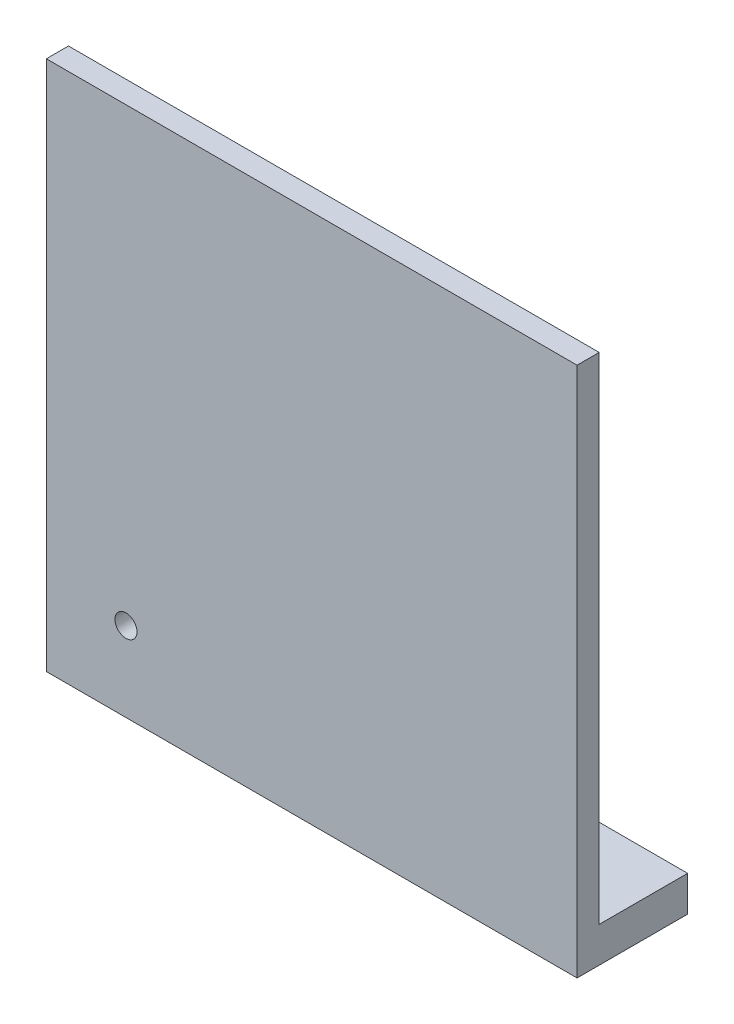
from build123d import *

# Parameters (mm, degrees)
SKETCH_1_W          = 1200
SKETCH_1_H          = 1200
EXTRUDE_1_DEPTH     = 50
SKETCH_2_W          = 1200
SKETCH_2_H          = 80
EXTRUDE_2_DEPTH     = 200
SKETCH_3_R          = 25
CUT_EXTRUDE_3_DEPTH = 1716.371679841


with BuildPart() as part:
    # Sketch 1 → Extrude 1 (new body)
    with BuildSketch(Plane.XY):
        with Locations((600, 600)):
            Rectangle(SKETCH_1_W, SKETCH_1_H)
    extrude(amount=-EXTRUDE_1_DEPTH)

    # Sketch 2 → Extrude 2 (add)
    with BuildSketch(Plane(origin=(0, 0, -50), x_dir=(-1, 0, 0), z_dir=(0, 0, -1))):
        with Locations((-600, 40)):
            Rectangle(SKETCH_2_W, SKETCH_2_H)
    extrude(amount=EXTRUDE_2_DEPTH)

    # Sketch 3 → Cut-Extrude 3 (cut, through all)
    with BuildSketch(Plane.XY):
        with Locations((180, 180)):
            Circle(SKETCH_3_R)
    extrude(amount=-CUT_EXTRUDE_3_DEPTH, mode=Mode.SUBTRACT)


solid = part.part
